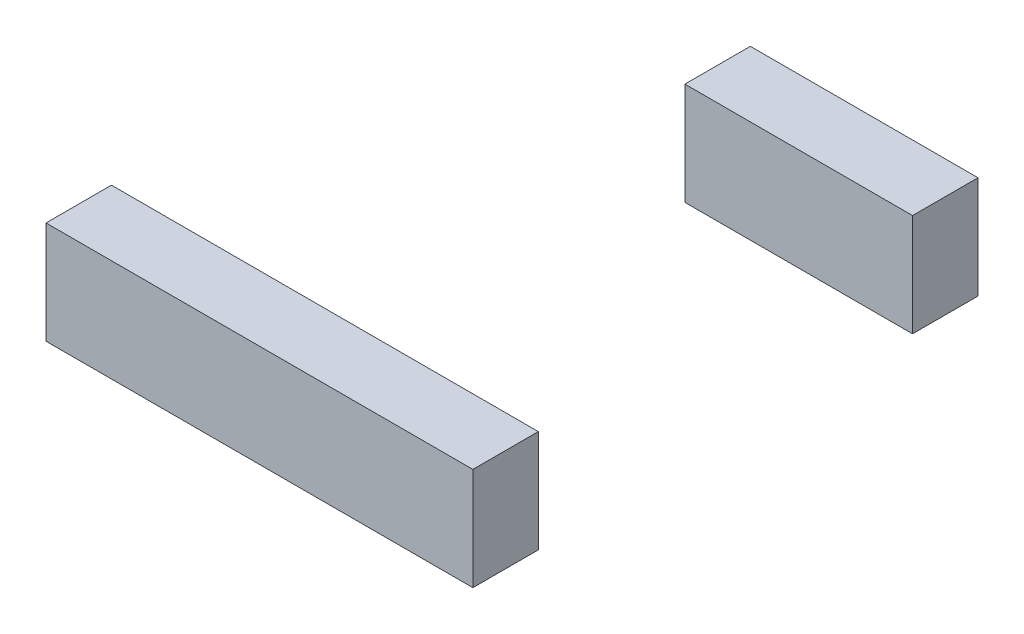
from build123d import *

# Parameters (mm, degrees)
SKETCH_1_W        = 30
SKETCH_1_H        = 4.6
EXTRUDE_1_DEPTH   = 7.2
SKETCH_1_W_2      = 16
EXTRUDE_1_2_DEPTH = 7.2


with BuildPart() as part:
    # Sketch 1 → Extrude 1 (new body)
    with BuildSketch(Plane(origin=(0, 0, 0), x_dir=(1, 0, 0), z_dir=(0, 1, 0))):
        with Locations((15, 2.3)):
            Rectangle(SKETCH_1_W, SKETCH_1_H)
    extrude(amount=EXTRUDE_1_DEPTH)


with BuildPart() as body_2:
    # Sketch 1 → Extrude 1 2 (new body)
    with BuildSketch(Plane(origin=(0, 0, 0), x_dir=(1, 0, 0), z_dir=(0, 1, 0))):
        with Locations((22, 33.2)):
            Rectangle(SKETCH_1_W_2, SKETCH_1_H)
    extrude(amount=EXTRUDE_1_2_DEPTH)


solid = Compound([part.part, body_2.part])
